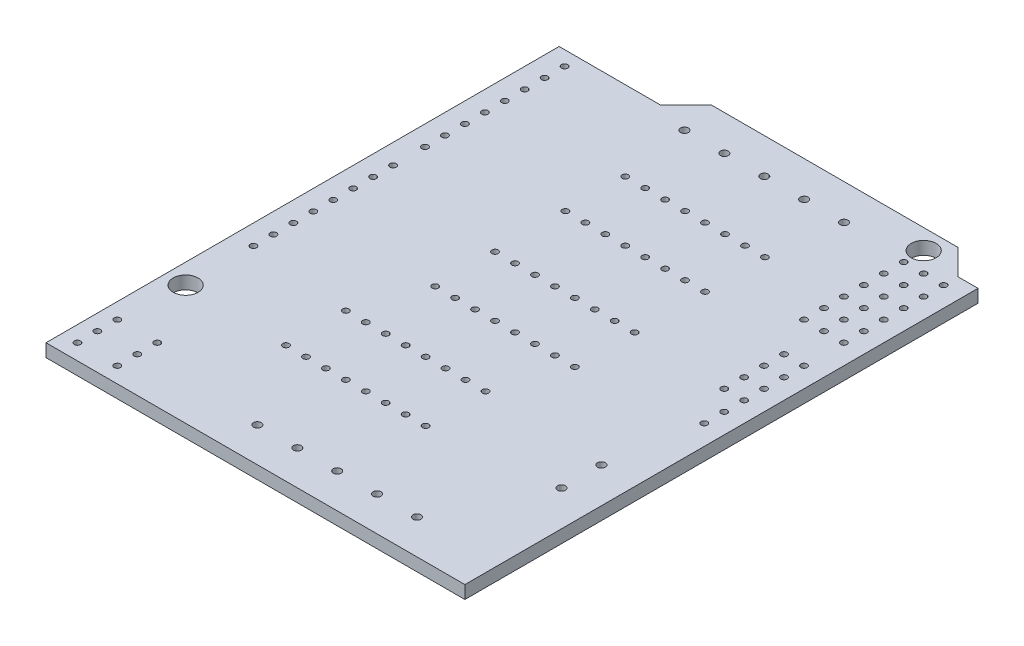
from build123d import *

# Parameters (mm, degrees)
ESQUISSE1_R                           = 1.5875
EXTRUSION1_DEPTH                      = 1.65
ESQUISSE2_R                           = 0.4
ENL_V_MAT_EXTRU_1_DEPTH               = 87.897033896
ESQUISSE3_R                           = 0.4
ENL_V_MAT_EXTRU_2_DEPTH               = 87.897033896
R_P_TITION_LIN_AIRE1_COUNT            = 13
R_P_TITION_LIN_AIRE1_PITCH            = 2.54
R_P_TITION_LIN_AIRE3_COUNT            = 8
R_P_TITION_LIN_AIRE3_PITCH            = 2.54
ESQUISSE4_R                           = 0.4
ENL_V_MAT_EXTRU_3_DEPTH               = 87.897033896
R_P_TITION_LIN_AIRE4_COUNT            = 8
R_P_TITION_LIN_AIRE4_PITCH            = 2.54
ESQUISSE5_R                           = 0.4
ENL_V_MAT_EXTRU_4_DEPTH               = 87.897033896
R_P_TITION_LIN_AIRE6_COUNT            = 11
R_P_TITION_LIN_AIRE6_PITCH            = 2.54
ESQUISSE6_R                           = 0.4
ENL_V_MAT_EXTRU_5_DEPTH               = 87.897033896
R_P_TITION_LIN_AIRE7_COUNT            = 6
R_P_TITION_LIN_AIRE7_PITCH            = 2.54
ESQUISSE7_R                           = 0.5
ENL_V_MAT_EXTRU_6_DEPTH               = 87.897033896
R_P_TITION_LIN_AIRE8_COUNT            = 5
R_P_TITION_LIN_AIRE8_PITCH            = 5.08
ESQUISSE8_R                           = 0.5
ENL_V_MAT_EXTRU_7_DEPTH               = 87.897033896
R_P_TITION_LIN_AIRE9_COUNT            = 5
R_P_TITION_LIN_AIRE9_PITCH            = 5.08
ESQUISSE9_R                           = 0.5
ENL_V_MAT_EXTRU_8_DEPTH               = 87.897033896
R_P_TITION_LIN_AIRE10_COUNT           = 2
R_P_TITION_LIN_AIRE10_PITCH           = 5.08
ESQUISSE10_R                          = 0.4
ENL_V_MAT_EXTRU_9_DEPTH               = 87.897033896
R_P_TITION_LIN_AIRE11_COUNT           = 8
R_P_TITION_LIN_AIRE11_PITCH           = 2.54
R_P_TITION_LIN_AIRE12_COUNT           = 2
R_P_TITION_LIN_AIRE12_PITCH           = 7.62
R_P_TITION_LIN_AIRE12_COPY_1_SKETCH_R = 0.4
R_P_TITION_LIN_AIRE12_COPY_1_DEPTH    = 87.897033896
R_P_TITION_LIN_AIRE12_COPY_2_SKETCH_R = 0.4
R_P_TITION_LIN_AIRE12_COPY_2_DEPTH    = 87.897033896
R_P_TITION_LIN_AIRE12_COPY_3_SKETCH_R = 0.4
R_P_TITION_LIN_AIRE12_COPY_3_DEPTH    = 87.897033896
R_P_TITION_LIN_AIRE12_COPY_4_SKETCH_R = 0.4
R_P_TITION_LIN_AIRE12_COPY_4_DEPTH    = 87.897033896
R_P_TITION_LIN_AIRE12_COPY_5_SKETCH_R = 0.4
R_P_TITION_LIN_AIRE12_COPY_5_DEPTH    = 87.897033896
R_P_TITION_LIN_AIRE12_COPY_6_SKETCH_R = 0.4
R_P_TITION_LIN_AIRE12_COPY_6_DEPTH    = 87.897033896
R_P_TITION_LIN_AIRE12_COPY_7_SKETCH_R = 0.4
R_P_TITION_LIN_AIRE12_COPY_7_DEPTH    = 87.897033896
ESQUISSE11_R                          = 0.4
ENL_V_MAT_EXTRU_10_DEPTH              = 87.897033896
R_P_TITION_LIN_AIRE13_COUNT           = 8
R_P_TITION_LIN_AIRE13_PITCH           = 2.54
R_P_TITION_LIN_AIRE14_COUNT           = 2
R_P_TITION_LIN_AIRE14_PITCH           = 7.62
R_P_TITION_LIN_AIRE14_COPY_1_SKETCH_R = 0.4
R_P_TITION_LIN_AIRE14_COPY_1_DEPTH    = 87.897033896
R_P_TITION_LIN_AIRE14_COPY_2_SKETCH_R = 0.4
R_P_TITION_LIN_AIRE14_COPY_2_DEPTH    = 87.897033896
R_P_TITION_LIN_AIRE14_COPY_3_SKETCH_R = 0.4
R_P_TITION_LIN_AIRE14_COPY_3_DEPTH    = 87.897033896
R_P_TITION_LIN_AIRE14_COPY_4_SKETCH_R = 0.4
R_P_TITION_LIN_AIRE14_COPY_4_DEPTH    = 87.897033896
R_P_TITION_LIN_AIRE14_COPY_5_SKETCH_R = 0.4
R_P_TITION_LIN_AIRE14_COPY_5_DEPTH    = 87.897033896
R_P_TITION_LIN_AIRE14_COPY_6_SKETCH_R = 0.4
R_P_TITION_LIN_AIRE14_COPY_6_DEPTH    = 87.897033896
R_P_TITION_LIN_AIRE14_COPY_7_SKETCH_R = 0.4
R_P_TITION_LIN_AIRE14_COPY_7_DEPTH    = 87.897033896
ESQUISSE12_R                          = 0.4
ENL_V_MAT_EXTRU_11_DEPTH              = 87.897033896
R_P_TITION_LIN_AIRE15_COUNT           = 8
R_P_TITION_LIN_AIRE15_PITCH           = 2.54
R_P_TITION_LIN_AIRE16_COUNT           = 2
R_P_TITION_LIN_AIRE16_PITCH           = 7.62
R_P_TITION_LIN_AIRE16_COPY_1_SKETCH_R = 0.4
R_P_TITION_LIN_AIRE16_COPY_1_DEPTH    = 87.897033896
R_P_TITION_LIN_AIRE16_COPY_2_SKETCH_R = 0.4
R_P_TITION_LIN_AIRE16_COPY_2_DEPTH    = 87.897033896
R_P_TITION_LIN_AIRE16_COPY_3_SKETCH_R = 0.4
R_P_TITION_LIN_AIRE16_COPY_3_DEPTH    = 87.897033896
R_P_TITION_LIN_AIRE16_COPY_4_SKETCH_R = 0.4
R_P_TITION_LIN_AIRE16_COPY_4_DEPTH    = 87.897033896
R_P_TITION_LIN_AIRE16_COPY_5_SKETCH_R = 0.4
R_P_TITION_LIN_AIRE16_COPY_5_DEPTH    = 87.897033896
R_P_TITION_LIN_AIRE16_COPY_6_SKETCH_R = 0.4
R_P_TITION_LIN_AIRE16_COPY_6_DEPTH    = 87.897033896
R_P_TITION_LIN_AIRE16_COPY_7_SKETCH_R = 0.4
R_P_TITION_LIN_AIRE16_COPY_7_DEPTH    = 87.897033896
ESQUISSE13_R                          = 0.4
ENL_V_MAT_EXTRU_12_DEPTH              = 87.897033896
R_P_TITION_LIN_AIRE17_COUNT           = 3
R_P_TITION_LIN_AIRE17_PITCH           = 2.54


with BuildPart() as part:
    # Esquisse1 → Extrusion1 (new body)
    with BuildSketch(Plane(origin=(0, 0, 0), x_dir=(1, 0, 0), z_dir=(0, 1, 0))):
        Polygon((-53.34, 65.338435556), (-40.39, 65.338435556), (-37.148435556, 68.58), (-5.781564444, 68.58), (-2.54, 65.338435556), (0, 65.338435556), (0, 0), (-53.34, 0), align=None)
        with Locations(Location((-7.62, 66.04, 0), (0, 0, 270))):
            Circle(ESQUISSE1_R, mode=Mode.SUBTRACT)
        with Locations(Location((-50.8, 15.24, 0), (0, 0, 270))):
            Circle(ESQUISSE1_R, mode=Mode.SUBTRACT)
    extrude(amount=EXTRUSION1_DEPTH)

    # Esquisse2 → Enl_v. mat.-Extru.1 (cut, through all)
    with BuildSketch(Plane(origin=(0, 1.65, 0), x_dir=(-1, 0, 0), z_dir=(0, 1, 0))):
        with Locations(Location((2.54, -33.02, 0), (0, 0, 90))):
            Circle(ESQUISSE2_R)
    enl_v_mat_extru_1 = extrude(amount=-ENL_V_MAT_EXTRU_1_DEPTH, mode=Mode.SUBTRACT)

    # Esquisse3 → Enl_v. mat.-Extru.2 (cut, through all)
    with BuildSketch(Plane(origin=(0, 1.65, 0), x_dir=(-1, 0, 0), z_dir=(0, 1, 0))):
        with Locations(Location((50.8, -23.88, 0), (0, 0, 90))):
            Circle(ESQUISSE3_R)
    enl_v_mat_extru_2 = extrude(amount=-ENL_V_MAT_EXTRU_2_DEPTH, mode=Mode.SUBTRACT)

    # R_p_tition lin_aire1: Enl_v. mat.-Extru.1 ×13, 1 skipped
    with Locations(*[(0, 0, -i * R_P_TITION_LIN_AIRE1_PITCH) for i in range(1, R_P_TITION_LIN_AIRE1_COUNT) if i not in (6,)]):
        add(enl_v_mat_extru_1, mode=Mode.SUBTRACT)

    # R_p_tition lin_aire3: Enl_v. mat.-Extru.2 ×8
    with Locations(*[(0, 0, -i * R_P_TITION_LIN_AIRE3_PITCH) for i in range(1, R_P_TITION_LIN_AIRE3_COUNT)]):
        add(enl_v_mat_extru_2, mode=Mode.SUBTRACT)

    # Esquisse4 → Enl_v. mat.-Extru.3 (cut, through all)
    with BuildSketch(Plane(origin=(0, 1.65, 0), x_dir=(-1, 0, 0), z_dir=(0, 1, 0))):
        with Locations(Location((50.8, -45.72, 0), (0, 0, 90))):
            Circle(ESQUISSE4_R)
    enl_v_mat_extru_3 = extrude(amount=-ENL_V_MAT_EXTRU_3_DEPTH, mode=Mode.SUBTRACT)

    # R_p_tition lin_aire4: Enl_v. mat.-Extru.3 ×8
    with Locations(*[(0, 0, -i * R_P_TITION_LIN_AIRE4_PITCH) for i in range(1, R_P_TITION_LIN_AIRE4_COUNT)]):
        add(enl_v_mat_extru_3, mode=Mode.SUBTRACT)

    # Esquisse5 → Enl_v. mat.-Extru.4 (cut, through all)
    with BuildSketch(Plane(origin=(0, 1.65, 0), x_dir=(-1, 0, 0), z_dir=(0, 1, 0))):
        with Locations(Location((5.08, -63.5, 0), (0, 0, 90))):
            Circle(ESQUISSE5_R)
    enl_v_mat_extru_4 = extrude(amount=-ENL_V_MAT_EXTRU_4_DEPTH, mode=Mode.SUBTRACT)

    # R_p_tition lin_aire6: Enl_v. mat.-Extru.4 ×11, 1 skipped
    with Locations(*[(0, 0, i * R_P_TITION_LIN_AIRE6_PITCH) for i in range(1, R_P_TITION_LIN_AIRE6_COUNT) if i not in (6,)]):
        add(enl_v_mat_extru_4, mode=Mode.SUBTRACT)

    # Esquisse6 → Enl_v. mat.-Extru.5 (cut, through all)
    with BuildSketch(Plane(origin=(0, 1.65, 0), x_dir=(-1, 0, 0), z_dir=(0, 1, 0))):
        with Locations(Location((7.62, -63.5, 0), (0, 0, 90))):
            Circle(ESQUISSE6_R)
    enl_v_mat_extru_5 = extrude(amount=-ENL_V_MAT_EXTRU_5_DEPTH, mode=Mode.SUBTRACT)

    # R_p_tition lin_aire7: Enl_v. mat.-Extru.5 ×6
    with Locations(*[(0, 0, i * R_P_TITION_LIN_AIRE7_PITCH) for i in range(1, R_P_TITION_LIN_AIRE7_COUNT)]):
        add(enl_v_mat_extru_5, mode=Mode.SUBTRACT)

    # Esquisse7 → Enl_v. mat.-Extru.6 (cut, through all)
    with BuildSketch(Plane(origin=(0, 1.65, 0), x_dir=(-1, 0, 0), z_dir=(0, 1, 0))):
        with Locations(Location((15.8, -64.08, 0), (0, 0, 90))):
            Circle(ESQUISSE7_R)
    enl_v_mat_extru_6 = extrude(amount=-ENL_V_MAT_EXTRU_6_DEPTH, mode=Mode.SUBTRACT)

    # R_p_tition lin_aire8: Enl_v. mat.-Extru.6 ×5
    with Locations(*[(-i * R_P_TITION_LIN_AIRE8_PITCH, 0, 0) for i in range(1, R_P_TITION_LIN_AIRE8_COUNT)]):
        add(enl_v_mat_extru_6, mode=Mode.SUBTRACT)

    # Esquisse8 → Enl_v. mat.-Extru.7 (cut, through all)
    with BuildSketch(Plane(origin=(0, 1.65, 0), x_dir=(-1, 0, 0), z_dir=(0, 1, 0))):
        with Locations(Location((10.5, -4.4, 0), (0, 0, 90))):
            Circle(ESQUISSE8_R)
    enl_v_mat_extru_7 = extrude(amount=-ENL_V_MAT_EXTRU_7_DEPTH, mode=Mode.SUBTRACT)

    # R_p_tition lin_aire9: Enl_v. mat.-Extru.7 ×5
    with Locations(*[(-i * R_P_TITION_LIN_AIRE9_PITCH, 0, 0) for i in range(1, R_P_TITION_LIN_AIRE9_COUNT)]):
        add(enl_v_mat_extru_7, mode=Mode.SUBTRACT)

    # Esquisse9 → Enl_v. mat.-Extru.8 (cut, through all)
    with BuildSketch(Plane(origin=(0, 1.65, 0), x_dir=(-1, 0, 0), z_dir=(0, 1, 0))):
        with Locations(Location((4.5, -16.8, 0), (0, 0, 90))):
            Circle(ESQUISSE9_R)
    enl_v_mat_extru_8 = extrude(amount=-ENL_V_MAT_EXTRU_8_DEPTH, mode=Mode.SUBTRACT)

    # R_p_tition lin_aire10: Enl_v. mat.-Extru.8 ×2
    with Locations(*[(0, 0, -i * R_P_TITION_LIN_AIRE10_PITCH) for i in range(1, R_P_TITION_LIN_AIRE10_COUNT)]):
        add(enl_v_mat_extru_8, mode=Mode.SUBTRACT)

    # Esquisse10 → Enl_v. mat.-Extru.9 (cut, through all)
    with BuildSketch(Plane(origin=(0, 1.65, 0), x_dir=(-1, 0, 0), z_dir=(0, 1, 0))):
        with Locations(Location((20, -15, 0), (0, 0, 90))):
            Circle(ESQUISSE10_R)
    enl_v_mat_extru_9 = extrude(amount=-ENL_V_MAT_EXTRU_9_DEPTH, mode=Mode.SUBTRACT)

    # R_p_tition lin_aire11: Enl_v. mat.-Extru.9 ×8
    with Locations(*[(-i * R_P_TITION_LIN_AIRE11_PITCH, 0, 0) for i in range(1, R_P_TITION_LIN_AIRE11_COUNT)]):
        add(enl_v_mat_extru_9, mode=Mode.SUBTRACT)

    # R_p_tition lin_aire12: Enl_v. mat.-Extru.9 ×2
    with Locations(*[(0, 0, -i * R_P_TITION_LIN_AIRE12_PITCH) for i in range(1, R_P_TITION_LIN_AIRE12_COUNT)]):
        add(enl_v_mat_extru_9, mode=Mode.SUBTRACT)

    # R_p_tition lin_aire12 copy 1 sketch → R_p_tition lin_aire12 copy 1 (cut, through all)
    with BuildSketch(Plane(origin=(-2.54, 1.65, -7.62), x_dir=(-1, 0, 0), z_dir=(0, 1, 0))):
        with Locations(Location((20, -15, 0), (0, 0, 90))):
            Circle(R_P_TITION_LIN_AIRE12_COPY_1_SKETCH_R)
    extrude(amount=-R_P_TITION_LIN_AIRE12_COPY_1_DEPTH, mode=Mode.SUBTRACT)

    # R_p_tition lin_aire12 copy 2 sketch → R_p_tition lin_aire12 copy 2 (cut, through all)
    with BuildSketch(Plane(origin=(-5.08, 1.65, -7.62), x_dir=(-1, 0, 0), z_dir=(0, 1, 0))):
        with Locations(Location((20, -15, 0), (0, 0, 90))):
            Circle(R_P_TITION_LIN_AIRE12_COPY_2_SKETCH_R)
    extrude(amount=-R_P_TITION_LIN_AIRE12_COPY_2_DEPTH, mode=Mode.SUBTRACT)

    # R_p_tition lin_aire12 copy 3 sketch → R_p_tition lin_aire12 copy 3 (cut, through all)
    with BuildSketch(Plane(origin=(-7.62, 1.65, -7.62), x_dir=(-1, 0, 0), z_dir=(0, 1, 0))):
        with Locations(Location((20, -15, 0), (0, 0, 90))):
            Circle(R_P_TITION_LIN_AIRE12_COPY_3_SKETCH_R)
    extrude(amount=-R_P_TITION_LIN_AIRE12_COPY_3_DEPTH, mode=Mode.SUBTRACT)

    # R_p_tition lin_aire12 copy 4 sketch → R_p_tition lin_aire12 copy 4 (cut, through all)
    with BuildSketch(Plane(origin=(-10.16, 1.65, -7.62), x_dir=(-1, 0, 0), z_dir=(0, 1, 0))):
        with Locations(Location((20, -15, 0), (0, 0, 90))):
            Circle(R_P_TITION_LIN_AIRE12_COPY_4_SKETCH_R)
    extrude(amount=-R_P_TITION_LIN_AIRE12_COPY_4_DEPTH, mode=Mode.SUBTRACT)

    # R_p_tition lin_aire12 copy 5 sketch → R_p_tition lin_aire12 copy 5 (cut, through all)
    with BuildSketch(Plane(origin=(-12.7, 1.65, -7.62), x_dir=(-1, 0, 0), z_dir=(0, 1, 0))):
        with Locations(Location((20, -15, 0), (0, 0, 90))):
            Circle(R_P_TITION_LIN_AIRE12_COPY_5_SKETCH_R)
    extrude(amount=-R_P_TITION_LIN_AIRE12_COPY_5_DEPTH, mode=Mode.SUBTRACT)

    # R_p_tition lin_aire12 copy 6 sketch → R_p_tition lin_aire12 copy 6 (cut, through all)
    with BuildSketch(Plane(origin=(-15.24, 1.65, -7.62), x_dir=(-1, 0, 0), z_dir=(0, 1, 0))):
        with Locations(Location((20, -15, 0), (0, 0, 90))):
            Circle(R_P_TITION_LIN_AIRE12_COPY_6_SKETCH_R)
    extrude(amount=-R_P_TITION_LIN_AIRE12_COPY_6_DEPTH, mode=Mode.SUBTRACT)

    # R_p_tition lin_aire12 copy 7 sketch → R_p_tition lin_aire12 copy 7 (cut, through all)
    with BuildSketch(Plane(origin=(-17.78, 1.65, -7.62), x_dir=(-1, 0, 0), z_dir=(0, 1, 0))):
        with Locations(Location((20, -15, 0), (0, 0, 90))):
            Circle(R_P_TITION_LIN_AIRE12_COPY_7_SKETCH_R)
    extrude(amount=-R_P_TITION_LIN_AIRE12_COPY_7_DEPTH, mode=Mode.SUBTRACT)

    # Esquisse11 → Enl_v. mat.-Extru.10 (cut, through all)
    with BuildSketch(Plane(origin=(0, 1.65, 0), x_dir=(-1, 0, 0), z_dir=(0, 1, 0))):
        with Locations(Location((17, -31, 0), (0, 0, 90))):
            Circle(ESQUISSE11_R)
    enl_v_mat_extru_10 = extrude(amount=-ENL_V_MAT_EXTRU_10_DEPTH, mode=Mode.SUBTRACT)

    # R_p_tition lin_aire13: Enl_v. mat.-Extru.10 ×8
    with Locations(*[(-i * R_P_TITION_LIN_AIRE13_PITCH, 0, 0) for i in range(1, R_P_TITION_LIN_AIRE13_COUNT)]):
        add(enl_v_mat_extru_10, mode=Mode.SUBTRACT)

    # R_p_tition lin_aire14: Enl_v. mat.-Extru.10 ×2
    with Locations(*[(0, 0, -i * R_P_TITION_LIN_AIRE14_PITCH) for i in range(1, R_P_TITION_LIN_AIRE14_COUNT)]):
        add(enl_v_mat_extru_10, mode=Mode.SUBTRACT)

    # R_p_tition lin_aire14 copy 1 sketch → R_p_tition lin_aire14 copy 1 (cut, through all)
    with BuildSketch(Plane(origin=(-2.54, 1.65, -7.62), x_dir=(-1, 0, 0), z_dir=(0, 1, 0))):
        with Locations(Location((17, -31, 0), (0, 0, 90))):
            Circle(R_P_TITION_LIN_AIRE14_COPY_1_SKETCH_R)
    extrude(amount=-R_P_TITION_LIN_AIRE14_COPY_1_DEPTH, mode=Mode.SUBTRACT)

    # R_p_tition lin_aire14 copy 2 sketch → R_p_tition lin_aire14 copy 2 (cut, through all)
    with BuildSketch(Plane(origin=(-5.08, 1.65, -7.62), x_dir=(-1, 0, 0), z_dir=(0, 1, 0))):
        with Locations(Location((17, -31, 0), (0, 0, 90))):
            Circle(R_P_TITION_LIN_AIRE14_COPY_2_SKETCH_R)
    extrude(amount=-R_P_TITION_LIN_AIRE14_COPY_2_DEPTH, mode=Mode.SUBTRACT)

    # R_p_tition lin_aire14 copy 3 sketch → R_p_tition lin_aire14 copy 3 (cut, through all)
    with BuildSketch(Plane(origin=(-7.62, 1.65, -7.62), x_dir=(-1, 0, 0), z_dir=(0, 1, 0))):
        with Locations(Location((17, -31, 0), (0, 0, 90))):
            Circle(R_P_TITION_LIN_AIRE14_COPY_3_SKETCH_R)
    extrude(amount=-R_P_TITION_LIN_AIRE14_COPY_3_DEPTH, mode=Mode.SUBTRACT)

    # R_p_tition lin_aire14 copy 4 sketch → R_p_tition lin_aire14 copy 4 (cut, through all)
    with BuildSketch(Plane(origin=(-10.16, 1.65, -7.62), x_dir=(-1, 0, 0), z_dir=(0, 1, 0))):
        with Locations(Location((17, -31, 0), (0, 0, 90))):
            Circle(R_P_TITION_LIN_AIRE14_COPY_4_SKETCH_R)
    extrude(amount=-R_P_TITION_LIN_AIRE14_COPY_4_DEPTH, mode=Mode.SUBTRACT)

    # R_p_tition lin_aire14 copy 5 sketch → R_p_tition lin_aire14 copy 5 (cut, through all)
    with BuildSketch(Plane(origin=(-12.7, 1.65, -7.62), x_dir=(-1, 0, 0), z_dir=(0, 1, 0))):
        with Locations(Location((17, -31, 0), (0, 0, 90))):
            Circle(R_P_TITION_LIN_AIRE14_COPY_5_SKETCH_R)
    extrude(amount=-R_P_TITION_LIN_AIRE14_COPY_5_DEPTH, mode=Mode.SUBTRACT)

    # R_p_tition lin_aire14 copy 6 sketch → R_p_tition lin_aire14 copy 6 (cut, through all)
    with BuildSketch(Plane(origin=(-15.24, 1.65, -7.62), x_dir=(-1, 0, 0), z_dir=(0, 1, 0))):
        with Locations(Location((17, -31, 0), (0, 0, 90))):
            Circle(R_P_TITION_LIN_AIRE14_COPY_6_SKETCH_R)
    extrude(amount=-R_P_TITION_LIN_AIRE14_COPY_6_DEPTH, mode=Mode.SUBTRACT)

    # R_p_tition lin_aire14 copy 7 sketch → R_p_tition lin_aire14 copy 7 (cut, through all)
    with BuildSketch(Plane(origin=(-17.78, 1.65, -7.62), x_dir=(-1, 0, 0), z_dir=(0, 1, 0))):
        with Locations(Location((17, -31, 0), (0, 0, 90))):
            Circle(R_P_TITION_LIN_AIRE14_COPY_7_SKETCH_R)
    extrude(amount=-R_P_TITION_LIN_AIRE14_COPY_7_DEPTH, mode=Mode.SUBTRACT)

    # Esquisse12 → Enl_v. mat.-Extru.11 (cut, through all)
    with BuildSketch(Plane(origin=(0, 1.65, 0), x_dir=(-1, 0, 0), z_dir=(0, 1, 0))):
        with Locations(Location((17, -47.58, 0), (0, 0, 90))):
            Circle(ESQUISSE12_R)
    enl_v_mat_extru_11 = extrude(amount=-ENL_V_MAT_EXTRU_11_DEPTH, mode=Mode.SUBTRACT)

    # R_p_tition lin_aire15: Enl_v. mat.-Extru.11 ×8
    with Locations(*[(-i * R_P_TITION_LIN_AIRE15_PITCH, 0, 0) for i in range(1, R_P_TITION_LIN_AIRE15_COUNT)]):
        add(enl_v_mat_extru_11, mode=Mode.SUBTRACT)

    # R_p_tition lin_aire16: Enl_v. mat.-Extru.11 ×2
    with Locations(*[(0, 0, -i * R_P_TITION_LIN_AIRE16_PITCH) for i in range(1, R_P_TITION_LIN_AIRE16_COUNT)]):
        add(enl_v_mat_extru_11, mode=Mode.SUBTRACT)

    # R_p_tition lin_aire16 copy 1 sketch → R_p_tition lin_aire16 copy 1 (cut, through all)
    with BuildSketch(Plane(origin=(-2.54, 1.65, -7.62), x_dir=(-1, 0, 0), z_dir=(0, 1, 0))):
        with Locations(Location((17, -47.58, 0), (0, 0, 90))):
            Circle(R_P_TITION_LIN_AIRE16_COPY_1_SKETCH_R)
    extrude(amount=-R_P_TITION_LIN_AIRE16_COPY_1_DEPTH, mode=Mode.SUBTRACT)

    # R_p_tition lin_aire16 copy 2 sketch → R_p_tition lin_aire16 copy 2 (cut, through all)
    with BuildSketch(Plane(origin=(-5.08, 1.65, -7.62), x_dir=(-1, 0, 0), z_dir=(0, 1, 0))):
        with Locations(Location((17, -47.58, 0), (0, 0, 90))):
            Circle(R_P_TITION_LIN_AIRE16_COPY_2_SKETCH_R)
    extrude(amount=-R_P_TITION_LIN_AIRE16_COPY_2_DEPTH, mode=Mode.SUBTRACT)

    # R_p_tition lin_aire16 copy 3 sketch → R_p_tition lin_aire16 copy 3 (cut, through all)
    with BuildSketch(Plane(origin=(-7.62, 1.65, -7.62), x_dir=(-1, 0, 0), z_dir=(0, 1, 0))):
        with Locations(Location((17, -47.58, 0), (0, 0, 90))):
            Circle(R_P_TITION_LIN_AIRE16_COPY_3_SKETCH_R)
    extrude(amount=-R_P_TITION_LIN_AIRE16_COPY_3_DEPTH, mode=Mode.SUBTRACT)

    # R_p_tition lin_aire16 copy 4 sketch → R_p_tition lin_aire16 copy 4 (cut, through all)
    with BuildSketch(Plane(origin=(-10.16, 1.65, -7.62), x_dir=(-1, 0, 0), z_dir=(0, 1, 0))):
        with Locations(Location((17, -47.58, 0), (0, 0, 90))):
            Circle(R_P_TITION_LIN_AIRE16_COPY_4_SKETCH_R)
    extrude(amount=-R_P_TITION_LIN_AIRE16_COPY_4_DEPTH, mode=Mode.SUBTRACT)

    # R_p_tition lin_aire16 copy 5 sketch → R_p_tition lin_aire16 copy 5 (cut, through all)
    with BuildSketch(Plane(origin=(-12.7, 1.65, -7.62), x_dir=(-1, 0, 0), z_dir=(0, 1, 0))):
        with Locations(Location((17, -47.58, 0), (0, 0, 90))):
            Circle(R_P_TITION_LIN_AIRE16_COPY_5_SKETCH_R)
    extrude(amount=-R_P_TITION_LIN_AIRE16_COPY_5_DEPTH, mode=Mode.SUBTRACT)

    # R_p_tition lin_aire16 copy 6 sketch → R_p_tition lin_aire16 copy 6 (cut, through all)
    with BuildSketch(Plane(origin=(-15.24, 1.65, -7.62), x_dir=(-1, 0, 0), z_dir=(0, 1, 0))):
        with Locations(Location((17, -47.58, 0), (0, 0, 90))):
            Circle(R_P_TITION_LIN_AIRE16_COPY_6_SKETCH_R)
    extrude(amount=-R_P_TITION_LIN_AIRE16_COPY_6_DEPTH, mode=Mode.SUBTRACT)

    # R_p_tition lin_aire16 copy 7 sketch → R_p_tition lin_aire16 copy 7 (cut, through all)
    with BuildSketch(Plane(origin=(-17.78, 1.65, -7.62), x_dir=(-1, 0, 0), z_dir=(0, 1, 0))):
        with Locations(Location((17, -47.58, 0), (0, 0, 90))):
            Circle(R_P_TITION_LIN_AIRE16_COPY_7_SKETCH_R)
    extrude(amount=-R_P_TITION_LIN_AIRE16_COPY_7_DEPTH, mode=Mode.SUBTRACT)

    # Esquisse13 → Enl_v. mat.-Extru.12 (cut, through all)
    with BuildSketch(Plane(origin=(0, 1.65, 0), x_dir=(-1, 0, 0), z_dir=(0, 1, 0))):
        with Locations(Location((51.34, -2, 0), (0, 0, 90))):
            Circle(ESQUISSE13_R)
        with Locations(Location((46.26, -2, 0), (0, 0, 90))):
            Circle(ESQUISSE13_R)
    enl_v_mat_extru_12 = extrude(amount=-ENL_V_MAT_EXTRU_12_DEPTH, mode=Mode.SUBTRACT)

    # R_p_tition lin_aire17: Enl_v. mat.-Extru.12 ×3
    with Locations(*[(0, 0, -i * R_P_TITION_LIN_AIRE17_PITCH) for i in range(1, R_P_TITION_LIN_AIRE17_COUNT)]):
        add(enl_v_mat_extru_12, mode=Mode.SUBTRACT)


solid = part.part
